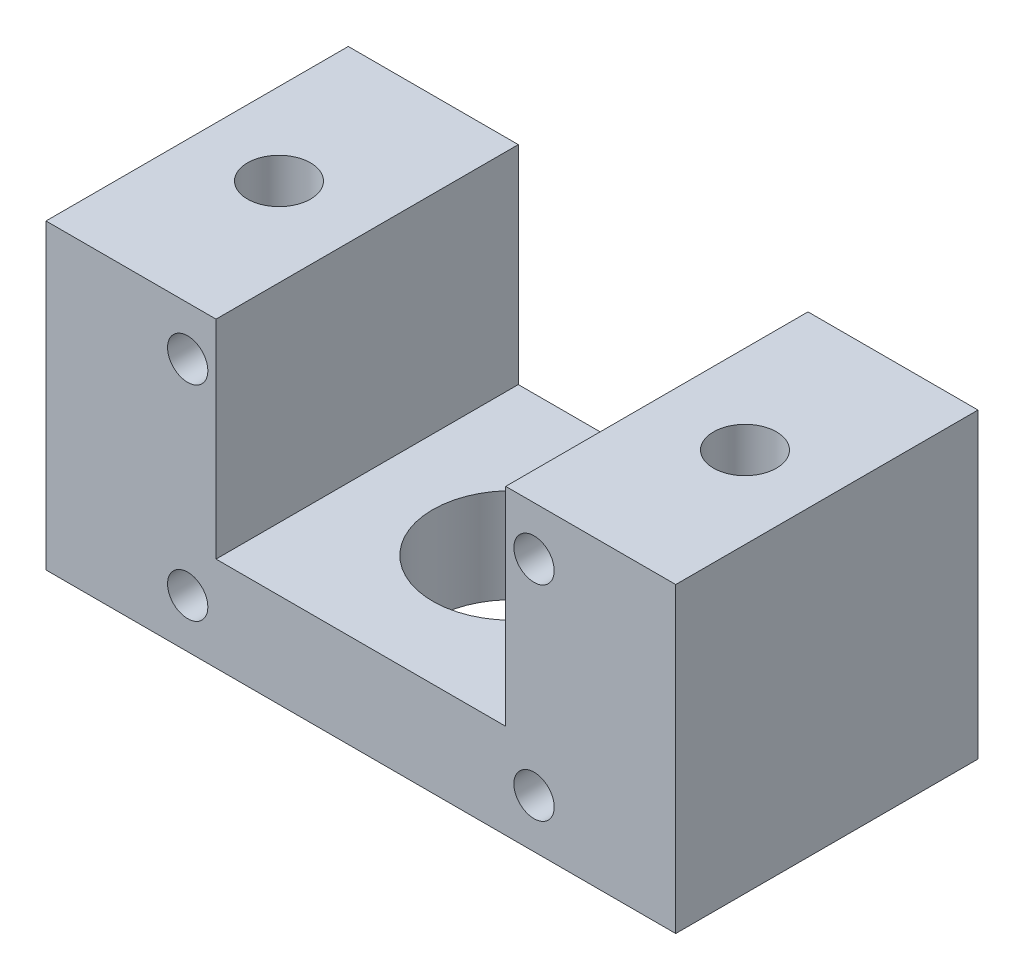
ISO-10303-21;
HEADER;
FILE_DESCRIPTION(('STEP AP214'),'2;1');
FILE_NAME('part.step','',(''),(''),'','','');
FILE_SCHEMA(('AUTOMOTIVE_DESIGN { 1 0 10303 214 1 1 1 1 }'));
ENDSEC;
DATA;
#1=APPLICATION_CONTEXT('core data for automotive mechanical design processes');
#2=APPLICATION_PROTOCOL_DEFINITION('international standard','automotive_design',2000,#1);
#3=PRODUCT_CONTEXT('',#1,'mechanical');
#4=PRODUCT('Part','Part','',(#3));
#5=PRODUCT_RELATED_PRODUCT_CATEGORY('part','',(#4));
#6=PRODUCT_DEFINITION_FORMATION('','',#4);
#7=PRODUCT_DEFINITION_CONTEXT('part definition',#1,'design');
#8=PRODUCT_DEFINITION('design','',#6,#7);
#9=PRODUCT_DEFINITION_SHAPE('','',#8);
#10=(LENGTH_UNIT() NAMED_UNIT(*) SI_UNIT(.MILLI.,.METRE.));
#11=(NAMED_UNIT(*) PLANE_ANGLE_UNIT() SI_UNIT($,.RADIAN.));
#12=(NAMED_UNIT(*) SI_UNIT($,.STERADIAN.) SOLID_ANGLE_UNIT());
#13=UNCERTAINTY_MEASURE_WITH_UNIT(LENGTH_MEASURE(1.E-05),#10,'distance_accuracy_value','');
#14=(GEOMETRIC_REPRESENTATION_CONTEXT(3) GLOBAL_UNCERTAINTY_ASSIGNED_CONTEXT((#13)) GLOBAL_UNIT_ASSIGNED_CONTEXT((#10,
#11,#12)) REPRESENTATION_CONTEXT('',''));
#15=CARTESIAN_POINT('',(0.,0.,0.));
#16=DIRECTION('',(0.,0.,1.));
#17=DIRECTION('',(1.,0.,0.));
#18=AXIS2_PLACEMENT_3D('',#15,#16,#17);
#19=CARTESIAN_POINT('',(-50.,48.,24.));
#20=DIRECTION('',(1.,0.,0.));
#21=DIRECTION('',(0.,1.,0.));
#22=AXIS2_PLACEMENT_3D('',#19,#20,#21);
#23=PLANE('',#22);
#24=DIRECTION('',(0.,-1.,0.));
#25=VECTOR('',#24,1.);
#26=CARTESIAN_POINT('',(-50.,48.,-24.));
#27=LINE('',#26,#25);
#28=CARTESIAN_POINT('',(-50.,48.,-24.));
#29=VERTEX_POINT('',#28);
#30=CARTESIAN_POINT('',(-50.,0.,-24.));
#31=VERTEX_POINT('',#30);
#32=EDGE_CURVE('E416',#29,#31,#27,.T.);
#33=ORIENTED_EDGE('',*,*,#32,.T.);
#34=DIRECTION('',(0.,0.,-1.));
#35=VECTOR('',#34,1.);
#36=CARTESIAN_POINT('',(-50.,0.,24.));
#37=LINE('',#36,#35);
#38=CARTESIAN_POINT('',(-50.,0.,24.));
#39=VERTEX_POINT('',#38);
#40=EDGE_CURVE('E11',#39,#31,#37,.T.);
#41=ORIENTED_EDGE('',*,*,#40,.F.);
#42=DIRECTION('',(0.,-1.,0.));
#43=VECTOR('',#42,1.);
#44=CARTESIAN_POINT('',(-50.,48.,24.));
#45=LINE('',#44,#43);
#46=CARTESIAN_POINT('',(-50.,48.,24.));
#47=VERTEX_POINT('',#46);
#48=EDGE_CURVE('E448',#47,#39,#45,.T.);
#49=ORIENTED_EDGE('',*,*,#48,.F.);
#50=DIRECTION('',(0.,0.,-1.));
#51=VECTOR('',#50,1.);
#52=CARTESIAN_POINT('',(-50.,48.,24.));
#53=LINE('',#52,#51);
#54=EDGE_CURVE('E429',#47,#29,#53,.T.);
#55=ORIENTED_EDGE('',*,*,#54,.T.);
#56=EDGE_LOOP('',(#33,#41,#49,#55));
#57=FACE_BOUND('',#56,.T.);
#58=ADVANCED_FACE('F348',(#57),#23,.F.);
#59=CARTESIAN_POINT('',(-50.,0.,24.));
#60=DIRECTION('',(0.,1.,0.));
#61=DIRECTION('',(-1.,0.,0.));
#62=AXIS2_PLACEMENT_3D('',#59,#60,#61);
#63=PLANE('',#62);
#64=CARTESIAN_POINT('',(0.,0.,0.));
#65=DIRECTION('',(0.,1.,0.));
#66=DIRECTION('',(-1.,0.,0.));
#67=AXIS2_PLACEMENT_3D('',#64,#65,#66);
#68=CIRCLE('',#67,12.6);
#69=CARTESIAN_POINT('',(-12.6,0.,0.));
#70=VERTEX_POINT('',#69);
#71=EDGE_CURVE('E537',#70,#70,#68,.T.);
#72=ORIENTED_EDGE('',*,*,#71,.T.);
#73=EDGE_LOOP('',(#72));
#74=FACE_BOUND('',#73,.T.);
#75=CARTESIAN_POINT('',(-37.,0.,0.));
#76=DIRECTION('',(0.,-1.,0.));
#77=DIRECTION('',(1.,0.,0.));
#78=AXIS2_PLACEMENT_3D('',#75,#76,#77);
#79=CIRCLE('',#78,5.);
#80=CARTESIAN_POINT('',(-32.,0.,0.));
#81=VERTEX_POINT('',#80);
#82=EDGE_CURVE('E539',#81,#81,#79,.T.);
#83=ORIENTED_EDGE('',*,*,#82,.F.);
#84=EDGE_LOOP('',(#83));
#85=FACE_BOUND('',#84,.T.);
#86=CARTESIAN_POINT('',(37.,0.,0.));
#87=DIRECTION('',(0.,-1.,0.));
#88=DIRECTION('',(1.,0.,0.));
#89=AXIS2_PLACEMENT_3D('',#86,#87,#88);
#90=CIRCLE('',#89,5.);
#91=CARTESIAN_POINT('',(42.,0.,0.));
#92=VERTEX_POINT('',#91);
#93=EDGE_CURVE('E546',#92,#92,#90,.T.);
#94=ORIENTED_EDGE('',*,*,#93,.F.);
#95=EDGE_LOOP('',(#94));
#96=FACE_BOUND('',#95,.T.);
#97=DIRECTION('',(1.,0.,0.));
#98=VECTOR('',#97,1.);
#99=CARTESIAN_POINT('',(-50.,0.,-24.));
#100=LINE('',#99,#98);
#101=CARTESIAN_POINT('',(50.,0.,-24.));
#102=VERTEX_POINT('',#101);
#103=EDGE_CURVE('E412',#31,#102,#100,.T.);
#104=ORIENTED_EDGE('',*,*,#103,.T.);
#105=DIRECTION('',(0.,0.,-1.));
#106=VECTOR('',#105,1.);
#107=CARTESIAN_POINT('',(50.,0.,24.));
#108=LINE('',#107,#106);
#109=CARTESIAN_POINT('',(50.,0.,24.));
#110=VERTEX_POINT('',#109);
#111=EDGE_CURVE('E355',#110,#102,#108,.T.);
#112=ORIENTED_EDGE('',*,*,#111,.F.);
#113=DIRECTION('',(1.,0.,0.));
#114=VECTOR('',#113,1.);
#115=CARTESIAN_POINT('',(-50.,0.,24.));
#116=LINE('',#115,#114);
#117=EDGE_CURVE('E425',#39,#110,#116,.T.);
#118=ORIENTED_EDGE('',*,*,#117,.F.);
#119=ORIENTED_EDGE('',*,*,#40,.T.);
#120=EDGE_LOOP('',(#104,#112,#118,#119));
#121=FACE_BOUND('',#120,.T.);
#122=ADVANCED_FACE('F424',(#74,#85,#96,#121),#63,.F.);
#123=CARTESIAN_POINT('',(50.,0.,24.));
#124=DIRECTION('',(-1.,0.,0.));
#125=DIRECTION('',(0.,-1.,0.));
#126=AXIS2_PLACEMENT_3D('',#123,#124,#125);
#127=PLANE('',#126);
#128=DIRECTION('',(0.,1.,0.));
#129=VECTOR('',#128,1.);
#130=CARTESIAN_POINT('',(50.,0.,-24.));
#131=LINE('',#130,#129);
#132=CARTESIAN_POINT('',(50.,48.,-24.));
#133=VERTEX_POINT('',#132);
#134=EDGE_CURVE('E418',#102,#133,#131,.T.);
#135=ORIENTED_EDGE('',*,*,#134,.T.);
#136=DIRECTION('',(0.,0.,-1.));
#137=VECTOR('',#136,1.);
#138=CARTESIAN_POINT('',(50.,48.,24.));
#139=LINE('',#138,#137);
#140=CARTESIAN_POINT('',(50.,48.,24.));
#141=VERTEX_POINT('',#140);
#142=EDGE_CURVE('E474',#141,#133,#139,.T.);
#143=ORIENTED_EDGE('',*,*,#142,.F.);
#144=DIRECTION('',(0.,1.,0.));
#145=VECTOR('',#144,1.);
#146=CARTESIAN_POINT('',(50.,0.,24.));
#147=LINE('',#146,#145);
#148=EDGE_CURVE('E451',#110,#141,#147,.T.);
#149=ORIENTED_EDGE('',*,*,#148,.F.);
#150=ORIENTED_EDGE('',*,*,#111,.T.);
#151=EDGE_LOOP('',(#135,#143,#149,#150));
#152=FACE_BOUND('',#151,.T.);
#153=ADVANCED_FACE('F478',(#152),#127,.F.);
#154=CARTESIAN_POINT('',(50.,48.,24.));
#155=DIRECTION('',(0.,-1.,0.));
#156=DIRECTION('',(0.,0.,-1.));
#157=AXIS2_PLACEMENT_3D('',#154,#155,#156);
#158=PLANE('',#157);
#159=CARTESIAN_POINT('',(37.,48.,0.));
#160=DIRECTION('',(0.,-1.,0.));
#161=DIRECTION('',(1.,0.,0.));
#162=AXIS2_PLACEMENT_3D('',#159,#160,#161);
#163=CIRCLE('',#162,5.);
#164=CARTESIAN_POINT('',(42.,48.,0.));
#165=VERTEX_POINT('',#164);
#166=EDGE_CURVE('E549',#165,#165,#163,.T.);
#167=ORIENTED_EDGE('',*,*,#166,.T.);
#168=EDGE_LOOP('',(#167));
#169=FACE_BOUND('',#168,.T.);
#170=DIRECTION('',(-1.,0.,0.));
#171=VECTOR('',#170,1.);
#172=CARTESIAN_POINT('',(50.,48.,-24.));
#173=LINE('',#172,#171);
#174=CARTESIAN_POINT('',(23.,48.,-24.));
#175=VERTEX_POINT('',#174);
#176=EDGE_CURVE('E438',#133,#175,#173,.T.);
#177=ORIENTED_EDGE('',*,*,#176,.T.);
#178=DIRECTION('',(0.,0.,-1.));
#179=VECTOR('',#178,1.);
#180=CARTESIAN_POINT('',(23.,48.,24.));
#181=LINE('',#180,#179);
#182=CARTESIAN_POINT('',(23.,48.,24.));
#183=VERTEX_POINT('',#182);
#184=EDGE_CURVE('E471',#183,#175,#181,.T.);
#185=ORIENTED_EDGE('',*,*,#184,.F.);
#186=DIRECTION('',(-1.,0.,0.));
#187=VECTOR('',#186,1.);
#188=CARTESIAN_POINT('',(50.,48.,24.));
#189=LINE('',#188,#187);
#190=EDGE_CURVE('E453',#141,#183,#189,.T.);
#191=ORIENTED_EDGE('',*,*,#190,.F.);
#192=ORIENTED_EDGE('',*,*,#142,.T.);
#193=EDGE_LOOP('',(#177,#185,#191,#192));
#194=FACE_BOUND('',#193,.T.);
#195=ADVANCED_FACE('F486',(#169,#194),#158,.F.);
#196=CARTESIAN_POINT('',(23.,48.,24.));
#197=DIRECTION('',(1.,0.,0.));
#198=DIRECTION('',(0.,1.,0.));
#199=AXIS2_PLACEMENT_3D('',#196,#197,#198);
#200=PLANE('',#199);
#201=DIRECTION('',(0.,-1.,0.));
#202=VECTOR('',#201,1.);
#203=CARTESIAN_POINT('',(23.,48.,-24.));
#204=LINE('',#203,#202);
#205=CARTESIAN_POINT('',(23.,14.9999999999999,-24.));
#206=VERTEX_POINT('',#205);
#207=EDGE_CURVE('E440',#175,#206,#204,.T.);
#208=ORIENTED_EDGE('',*,*,#207,.T.);
#209=DIRECTION('',(0.,0.,-1.));
#210=VECTOR('',#209,1.);
#211=CARTESIAN_POINT('',(23.,14.9999999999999,24.));
#212=LINE('',#211,#210);
#213=CARTESIAN_POINT('',(23.,14.9999999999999,24.));
#214=VERTEX_POINT('',#213);
#215=EDGE_CURVE('E468',#214,#206,#212,.T.);
#216=ORIENTED_EDGE('',*,*,#215,.F.);
#217=DIRECTION('',(0.,-1.,0.));
#218=VECTOR('',#217,1.);
#219=CARTESIAN_POINT('',(23.,48.,24.));
#220=LINE('',#219,#218);
#221=EDGE_CURVE('E455',#183,#214,#220,.T.);
#222=ORIENTED_EDGE('',*,*,#221,.F.);
#223=ORIENTED_EDGE('',*,*,#184,.T.);
#224=EDGE_LOOP('',(#208,#216,#222,#223));
#225=FACE_BOUND('',#224,.T.);
#226=ADVANCED_FACE('F489',(#225),#200,.F.);
#227=CARTESIAN_POINT('',(23.,14.9999999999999,24.));
#228=DIRECTION('',(0.,-1.,0.));
#229=DIRECTION('',(1.,0.,0.));
#230=AXIS2_PLACEMENT_3D('',#227,#228,#229);
#231=PLANE('',#230);
#232=CARTESIAN_POINT('',(0.,14.9999999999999,0.));
#233=DIRECTION('',(0.,1.,0.));
#234=DIRECTION('',(-1.,0.,0.));
#235=AXIS2_PLACEMENT_3D('',#232,#233,#234);
#236=CIRCLE('',#235,12.6);
#237=CARTESIAN_POINT('',(-12.6,14.9999999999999,0.));
#238=VERTEX_POINT('',#237);
#239=EDGE_CURVE('E535',#238,#238,#236,.T.);
#240=ORIENTED_EDGE('',*,*,#239,.F.);
#241=EDGE_LOOP('',(#240));
#242=FACE_BOUND('',#241,.T.);
#243=DIRECTION('',(-1.,0.,0.));
#244=VECTOR('',#243,1.);
#245=CARTESIAN_POINT('',(23.,14.9999999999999,-24.));
#246=LINE('',#245,#244);
#247=CARTESIAN_POINT('',(-23.,14.9999999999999,-24.));
#248=VERTEX_POINT('',#247);
#249=EDGE_CURVE('E442',#206,#248,#246,.T.);
#250=ORIENTED_EDGE('',*,*,#249,.T.);
#251=DIRECTION('',(0.,0.,-1.));
#252=VECTOR('',#251,1.);
#253=CARTESIAN_POINT('',(-23.,14.9999999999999,24.));
#254=LINE('',#253,#252);
#255=CARTESIAN_POINT('',(-23.,14.9999999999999,24.));
#256=VERTEX_POINT('',#255);
#257=EDGE_CURVE('E465',#256,#248,#254,.T.);
#258=ORIENTED_EDGE('',*,*,#257,.F.);
#259=DIRECTION('',(-1.,0.,0.));
#260=VECTOR('',#259,1.);
#261=CARTESIAN_POINT('',(23.,14.9999999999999,24.));
#262=LINE('',#261,#260);
#263=EDGE_CURVE('E457',#214,#256,#262,.T.);
#264=ORIENTED_EDGE('',*,*,#263,.F.);
#265=ORIENTED_EDGE('',*,*,#215,.T.);
#266=EDGE_LOOP('',(#250,#258,#264,#265));
#267=FACE_BOUND('',#266,.T.);
#268=ADVANCED_FACE('F494',(#242,#267),#231,.F.);
#269=CARTESIAN_POINT('',(-23.,14.9999999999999,24.));
#270=DIRECTION('',(-1.,0.,0.));
#271=DIRECTION('',(0.,-1.,0.));
#272=AXIS2_PLACEMENT_3D('',#269,#270,#271);
#273=PLANE('',#272);
#274=DIRECTION('',(0.,1.,0.));
#275=VECTOR('',#274,1.);
#276=CARTESIAN_POINT('',(-23.,14.9999999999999,-24.));
#277=LINE('',#276,#275);
#278=CARTESIAN_POINT('',(-23.,48.,-24.));
#279=VERTEX_POINT('',#278);
#280=EDGE_CURVE('E444',#248,#279,#277,.T.);
#281=ORIENTED_EDGE('',*,*,#280,.T.);
#282=DIRECTION('',(0.,0.,-1.));
#283=VECTOR('',#282,1.);
#284=CARTESIAN_POINT('',(-23.,48.,24.));
#285=LINE('',#284,#283);
#286=CARTESIAN_POINT('',(-23.,48.,24.));
#287=VERTEX_POINT('',#286);
#288=EDGE_CURVE('E462',#287,#279,#285,.T.);
#289=ORIENTED_EDGE('',*,*,#288,.F.);
#290=DIRECTION('',(0.,1.,0.));
#291=VECTOR('',#290,1.);
#292=CARTESIAN_POINT('',(-23.,14.9999999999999,24.));
#293=LINE('',#292,#291);
#294=EDGE_CURVE('E367',#256,#287,#293,.T.);
#295=ORIENTED_EDGE('',*,*,#294,.F.);
#296=ORIENTED_EDGE('',*,*,#257,.T.);
#297=EDGE_LOOP('',(#281,#289,#295,#296));
#298=FACE_BOUND('',#297,.T.);
#299=ADVANCED_FACE('F497',(#298),#273,.F.);
#300=CARTESIAN_POINT('',(-23.,48.,24.));
#301=DIRECTION('',(0.,-1.,0.));
#302=DIRECTION('',(1.,0.,0.));
#303=AXIS2_PLACEMENT_3D('',#300,#301,#302);
#304=PLANE('',#303);
#305=CARTESIAN_POINT('',(-37.,48.,0.));
#306=DIRECTION('',(0.,-1.,0.));
#307=DIRECTION('',(1.,0.,0.));
#308=AXIS2_PLACEMENT_3D('',#305,#306,#307);
#309=CIRCLE('',#308,5.);
#310=CARTESIAN_POINT('',(-32.,48.,0.));
#311=VERTEX_POINT('',#310);
#312=EDGE_CURVE('E544',#311,#311,#309,.T.);
#313=ORIENTED_EDGE('',*,*,#312,.T.);
#314=EDGE_LOOP('',(#313));
#315=FACE_BOUND('',#314,.T.);
#316=DIRECTION('',(-1.,0.,0.));
#317=VECTOR('',#316,1.);
#318=CARTESIAN_POINT('',(-23.,48.,-24.));
#319=LINE('',#318,#317);
#320=EDGE_CURVE('E446',#279,#29,#319,.T.);
#321=ORIENTED_EDGE('',*,*,#320,.T.);
#322=ORIENTED_EDGE('',*,*,#54,.F.);
#323=DIRECTION('',(-1.,0.,0.));
#324=VECTOR('',#323,1.);
#325=CARTESIAN_POINT('',(-23.,48.,24.));
#326=LINE('',#325,#324);
#327=EDGE_CURVE('E362',#287,#47,#326,.T.);
#328=ORIENTED_EDGE('',*,*,#327,.F.);
#329=ORIENTED_EDGE('',*,*,#288,.T.);
#330=EDGE_LOOP('',(#321,#322,#328,#329));
#331=FACE_BOUND('',#330,.T.);
#332=ADVANCED_FACE('F499',(#315,#331),#304,.F.);
#333=CARTESIAN_POINT('',(-50.,0.,24.));
#334=DIRECTION('',(0.,0.,1.));
#335=DIRECTION('',(1.,0.,0.));
#336=AXIS2_PLACEMENT_3D('',#333,#334,#335);
#337=PLANE('',#336);
#338=CARTESIAN_POINT('',(-27.5,40.2499999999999,24.));
#339=DIRECTION('',(0.,0.,1.));
#340=DIRECTION('',(1.,0.,0.));
#341=AXIS2_PLACEMENT_3D('',#338,#339,#340);
#342=CIRCLE('',#341,3.19999999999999);
#343=CARTESIAN_POINT('',(-24.3,40.2499999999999,24.));
#344=VERTEX_POINT('',#343);
#345=EDGE_CURVE('E555',#344,#344,#342,.T.);
#346=ORIENTED_EDGE('',*,*,#345,.F.);
#347=EDGE_LOOP('',(#346));
#348=FACE_BOUND('',#347,.T.);
#349=CARTESIAN_POINT('',(-27.5,7.74999999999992,24.));
#350=DIRECTION('',(0.,0.,1.));
#351=DIRECTION('',(1.,0.,0.));
#352=AXIS2_PLACEMENT_3D('',#349,#350,#351);
#353=CIRCLE('',#352,3.19999999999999);
#354=CARTESIAN_POINT('',(-24.3,7.74999999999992,24.));
#355=VERTEX_POINT('',#354);
#356=EDGE_CURVE('E561',#355,#355,#353,.T.);
#357=ORIENTED_EDGE('',*,*,#356,.F.);
#358=EDGE_LOOP('',(#357));
#359=FACE_BOUND('',#358,.T.);
#360=CARTESIAN_POINT('',(27.5,7.74999999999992,24.));
#361=DIRECTION('',(0.,0.,1.));
#362=DIRECTION('',(1.,0.,0.));
#363=AXIS2_PLACEMENT_3D('',#360,#361,#362);
#364=CIRCLE('',#363,3.19999999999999);
#365=CARTESIAN_POINT('',(30.7,7.74999999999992,24.));
#366=VERTEX_POINT('',#365);
#367=EDGE_CURVE('E567',#366,#366,#364,.T.);
#368=ORIENTED_EDGE('',*,*,#367,.F.);
#369=EDGE_LOOP('',(#368));
#370=FACE_BOUND('',#369,.T.);
#371=CARTESIAN_POINT('',(27.5,40.2499999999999,24.));
#372=DIRECTION('',(0.,0.,1.));
#373=DIRECTION('',(1.,0.,0.));
#374=AXIS2_PLACEMENT_3D('',#371,#372,#373);
#375=CIRCLE('',#374,3.19999999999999);
#376=CARTESIAN_POINT('',(30.7,40.2499999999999,24.));
#377=VERTEX_POINT('',#376);
#378=EDGE_CURVE('E430',#377,#377,#375,.T.);
#379=ORIENTED_EDGE('',*,*,#378,.F.);
#380=EDGE_LOOP('',(#379));
#381=FACE_BOUND('',#380,.T.);
#382=ORIENTED_EDGE('',*,*,#48,.T.);
#383=ORIENTED_EDGE('',*,*,#117,.T.);
#384=ORIENTED_EDGE('',*,*,#148,.T.);
#385=ORIENTED_EDGE('',*,*,#190,.T.);
#386=ORIENTED_EDGE('',*,*,#221,.T.);
#387=ORIENTED_EDGE('',*,*,#263,.T.);
#388=ORIENTED_EDGE('',*,*,#294,.T.);
#389=ORIENTED_EDGE('',*,*,#327,.T.);
#390=EDGE_LOOP('',(#382,#383,#384,#385,#386,#387,#388,#389));
#391=FACE_BOUND('',#390,.T.);
#392=ADVANCED_FACE('F481',(#348,#359,#370,#381,#391),#337,.T.);
#393=CARTESIAN_POINT('',(-50.,0.,-24.));
#394=DIRECTION('',(0.,0.,1.));
#395=DIRECTION('',(1.,0.,0.));
#396=AXIS2_PLACEMENT_3D('',#393,#394,#395);
#397=PLANE('',#396);
#398=CARTESIAN_POINT('',(-27.5,40.2499999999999,-24.));
#399=DIRECTION('',(0.,0.,1.));
#400=DIRECTION('',(1.,0.,0.));
#401=AXIS2_PLACEMENT_3D('',#398,#399,#400);
#402=CIRCLE('',#401,3.19999999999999);
#403=CARTESIAN_POINT('',(-24.3,40.2499999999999,-24.));
#404=VERTEX_POINT('',#403);
#405=EDGE_CURVE('E552',#404,#404,#402,.T.);
#406=ORIENTED_EDGE('',*,*,#405,.T.);
#407=EDGE_LOOP('',(#406));
#408=FACE_BOUND('',#407,.T.);
#409=CARTESIAN_POINT('',(-27.5,7.74999999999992,-24.));
#410=DIRECTION('',(0.,0.,1.));
#411=DIRECTION('',(1.,0.,0.));
#412=AXIS2_PLACEMENT_3D('',#409,#410,#411);
#413=CIRCLE('',#412,3.19999999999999);
#414=CARTESIAN_POINT('',(-24.3,7.74999999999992,-24.));
#415=VERTEX_POINT('',#414);
#416=EDGE_CURVE('E558',#415,#415,#413,.T.);
#417=ORIENTED_EDGE('',*,*,#416,.T.);
#418=EDGE_LOOP('',(#417));
#419=FACE_BOUND('',#418,.T.);
#420=CARTESIAN_POINT('',(27.5,7.74999999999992,-24.));
#421=DIRECTION('',(0.,0.,1.));
#422=DIRECTION('',(1.,0.,0.));
#423=AXIS2_PLACEMENT_3D('',#420,#421,#422);
#424=CIRCLE('',#423,3.19999999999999);
#425=CARTESIAN_POINT('',(30.7,7.74999999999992,-24.));
#426=VERTEX_POINT('',#425);
#427=EDGE_CURVE('E564',#426,#426,#424,.T.);
#428=ORIENTED_EDGE('',*,*,#427,.T.);
#429=EDGE_LOOP('',(#428));
#430=FACE_BOUND('',#429,.T.);
#431=CARTESIAN_POINT('',(27.5,40.2499999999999,-24.));
#432=DIRECTION('',(0.,0.,1.));
#433=DIRECTION('',(1.,0.,0.));
#434=AXIS2_PLACEMENT_3D('',#431,#432,#433);
#435=CIRCLE('',#434,3.19999999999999);
#436=CARTESIAN_POINT('',(30.7,40.2499999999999,-24.));
#437=VERTEX_POINT('',#436);
#438=EDGE_CURVE('E433',#437,#437,#435,.T.);
#439=ORIENTED_EDGE('',*,*,#438,.T.);
#440=EDGE_LOOP('',(#439));
#441=FACE_BOUND('',#440,.T.);
#442=ORIENTED_EDGE('',*,*,#32,.F.);
#443=ORIENTED_EDGE('',*,*,#320,.F.);
#444=ORIENTED_EDGE('',*,*,#280,.F.);
#445=ORIENTED_EDGE('',*,*,#249,.F.);
#446=ORIENTED_EDGE('',*,*,#207,.F.);
#447=ORIENTED_EDGE('',*,*,#176,.F.);
#448=ORIENTED_EDGE('',*,*,#134,.F.);
#449=ORIENTED_EDGE('',*,*,#103,.F.);
#450=EDGE_LOOP('',(#442,#443,#444,#445,#446,#447,#448,#449));
#451=FACE_BOUND('',#450,.T.);
#452=ADVANCED_FACE('F413',(#408,#419,#430,#441,#451),#397,.F.);
#453=CARTESIAN_POINT('',(27.5,40.2499999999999,24.));
#454=DIRECTION('',(0.,0.,1.));
#455=DIRECTION('',(1.,0.,0.));
#456=AXIS2_PLACEMENT_3D('',#453,#454,#455);
#457=CYLINDRICAL_SURFACE('',#456,3.19999999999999);
#458=ORIENTED_EDGE('',*,*,#438,.F.);
#459=EDGE_LOOP('',(#458));
#460=FACE_BOUND('',#459,.T.);
#461=ORIENTED_EDGE('',*,*,#378,.T.);
#462=EDGE_LOOP('',(#461));
#463=FACE_BOUND('',#462,.T.);
#464=ADVANCED_FACE('F573',(#460,#463),#457,.F.);
#465=CARTESIAN_POINT('',(27.5,7.74999999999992,24.));
#466=DIRECTION('',(0.,0.,1.));
#467=DIRECTION('',(1.,0.,0.));
#468=AXIS2_PLACEMENT_3D('',#465,#466,#467);
#469=CYLINDRICAL_SURFACE('',#468,3.19999999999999);
#470=ORIENTED_EDGE('',*,*,#427,.F.);
#471=EDGE_LOOP('',(#470));
#472=FACE_BOUND('',#471,.T.);
#473=ORIENTED_EDGE('',*,*,#367,.T.);
#474=EDGE_LOOP('',(#473));
#475=FACE_BOUND('',#474,.T.);
#476=ADVANCED_FACE('F576',(#472,#475),#469,.F.);
#477=CARTESIAN_POINT('',(-27.5,7.74999999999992,24.));
#478=DIRECTION('',(0.,0.,1.));
#479=DIRECTION('',(1.,0.,0.));
#480=AXIS2_PLACEMENT_3D('',#477,#478,#479);
#481=CYLINDRICAL_SURFACE('',#480,3.19999999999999);
#482=ORIENTED_EDGE('',*,*,#416,.F.);
#483=EDGE_LOOP('',(#482));
#484=FACE_BOUND('',#483,.T.);
#485=ORIENTED_EDGE('',*,*,#356,.T.);
#486=EDGE_LOOP('',(#485));
#487=FACE_BOUND('',#486,.T.);
#488=ADVANCED_FACE('F583',(#484,#487),#481,.F.);
#489=CARTESIAN_POINT('',(-27.5,40.2499999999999,24.));
#490=DIRECTION('',(0.,0.,1.));
#491=DIRECTION('',(1.,0.,0.));
#492=AXIS2_PLACEMENT_3D('',#489,#490,#491);
#493=CYLINDRICAL_SURFACE('',#492,3.19999999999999);
#494=ORIENTED_EDGE('',*,*,#405,.F.);
#495=EDGE_LOOP('',(#494));
#496=FACE_BOUND('',#495,.T.);
#497=ORIENTED_EDGE('',*,*,#345,.T.);
#498=EDGE_LOOP('',(#497));
#499=FACE_BOUND('',#498,.T.);
#500=ADVANCED_FACE('F591',(#496,#499),#493,.F.);
#501=CARTESIAN_POINT('',(37.,48.,0.));
#502=DIRECTION('',(0.,-1.,0.));
#503=DIRECTION('',(1.,0.,0.));
#504=AXIS2_PLACEMENT_3D('',#501,#502,#503);
#505=CYLINDRICAL_SURFACE('',#504,5.);
#506=ORIENTED_EDGE('',*,*,#166,.F.);
#507=EDGE_LOOP('',(#506));
#508=FACE_BOUND('',#507,.T.);
#509=ORIENTED_EDGE('',*,*,#93,.T.);
#510=EDGE_LOOP('',(#509));
#511=FACE_BOUND('',#510,.T.);
#512=ADVANCED_FACE('F595',(#508,#511),#505,.F.);
#513=CARTESIAN_POINT('',(-37.,48.,0.));
#514=DIRECTION('',(0.,-1.,0.));
#515=DIRECTION('',(1.,0.,0.));
#516=AXIS2_PLACEMENT_3D('',#513,#514,#515);
#517=CYLINDRICAL_SURFACE('',#516,5.);
#518=ORIENTED_EDGE('',*,*,#312,.F.);
#519=EDGE_LOOP('',(#518));
#520=FACE_BOUND('',#519,.T.);
#521=ORIENTED_EDGE('',*,*,#82,.T.);
#522=EDGE_LOOP('',(#521));
#523=FACE_BOUND('',#522,.T.);
#524=ADVANCED_FACE('F599',(#520,#523),#517,.F.);
#525=CARTESIAN_POINT('',(0.,0.,0.));
#526=DIRECTION('',(0.,1.,0.));
#527=DIRECTION('',(-1.,0.,0.));
#528=AXIS2_PLACEMENT_3D('',#525,#526,#527);
#529=CYLINDRICAL_SURFACE('',#528,12.6);
#530=ORIENTED_EDGE('',*,*,#71,.F.);
#531=EDGE_LOOP('',(#530));
#532=FACE_BOUND('',#531,.T.);
#533=ORIENTED_EDGE('',*,*,#239,.T.);
#534=EDGE_LOOP('',(#533));
#535=FACE_BOUND('',#534,.T.);
#536=ADVANCED_FACE('F603',(#532,#535),#529,.F.);
#537=CLOSED_SHELL('',(#58,#122,#153,#195,#226,#268,#299,#332,#392,#452,#464,#476,#488,#500,#512,
#524,#536));
#538=MANIFOLD_SOLID_BREP('B2',#537);
#539=ADVANCED_BREP_SHAPE_REPRESENTATION('',(#18,#538),#14);
#540=SHAPE_DEFINITION_REPRESENTATION(#9,#539);
ENDSEC;
END-ISO-10303-21;
